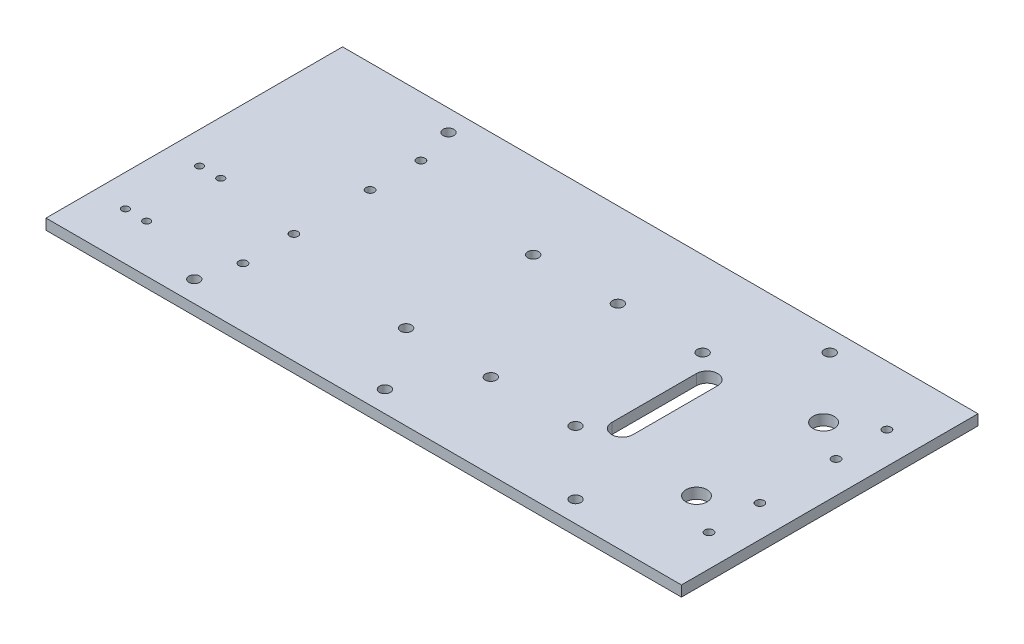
from build123d import *

# Parameters (mm, degrees)
SKETCH1_W                  = 381
SKETCH1_H                  = 177.8
PLATE_DEPTH                = 6.35
SKETCH4_R                  = 3.2639
CHASSISMOUNTINGHOLES_DEPTH = 6.35
SKETCH5_R                  = 2.5019
LEADSCREWGUIDEMOUNTS_DEPTH = 6.35
SKETCH6_R                  = 2.15265
LEADSCREWMOTORMOUNT_DEPTH  = 6.35
SKETCH8_R                  = 3.2639
CUT_EXTRUDE2_DEPTH         = 211.318288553
SKETCH9_R                  = 6.35
CUT_EXTRUDE3_DEPTH         = 211.318288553


with BuildPart() as part:
    # Sketch1 → Plate (new body)
    with BuildSketch(Plane(origin=(0, 0, 0), x_dir=(1, 0, 0), z_dir=(0, 1, 0))):
        Rectangle(SKETCH1_W, SKETCH1_H)
    extrude(amount=PLATE_DEPTH)

    # Sketch4 → ChassisMountingHoles (cut)
    with BuildSketch(Plane.XZ):
        with Locations(Location((0, 76.2, 0), (0, 0, 270))):
            Circle(SKETCH4_R)
        with Locations(Location((-114.3, 76.2, 0), (0, 0, 270))):
            Circle(SKETCH4_R)
        with Locations(Location((114.3, 76.2, 0), (0, 0, 270))):
            Circle(SKETCH4_R)
        with Locations(Location((-114.3, -76.2, 0), (0, 0, 270))):
            Circle(SKETCH4_R)
        with Locations(Location((114.3, -76.2, 0), (0, 0, 270))):
            Circle(SKETCH4_R)
    extrude(amount=-CHASSISMOUNTINGHOLES_DEPTH, mode=Mode.SUBTRACT)

    # Sketch5 → LeadScrewGuideMounts (cut)
    with BuildSketch(Plane.XZ):
        with Locations(Location((171.45, 53.34, 0), (0, 0, 270))):
            Circle(SKETCH5_R)
        with Locations(Location((171.45, 22.86, 0), (0, 0, 270))):
            Circle(SKETCH5_R)
        with Locations(Location((-107.95, 53.34, 0), (0, 0, 270))):
            Circle(SKETCH5_R)
        with Locations(Location((-107.95, 22.86, 0), (0, 0, 270))):
            Circle(SKETCH5_R)
        with Locations(Location((171.45, -53.34, 0), (0, 0, 270))):
            Circle(SKETCH5_R)
        with Locations(Location((171.45, -22.86, 0), (0, 0, 270))):
            Circle(SKETCH5_R)
        with Locations(Location((-107.95, -22.86, 0), (0, 0, 270))):
            Circle(SKETCH5_R)
        with Locations(Location((-107.95, -53.34, 0), (0, 0, 270))):
            Circle(SKETCH5_R)
    extrude(amount=-LEADSCREWGUIDEMOUNTS_DEPTH, mode=Mode.SUBTRACT)

    # Sketch6 → LeadScrewMotorMount (cut)
    with BuildSketch(Plane.XZ):
        with Locations(Location((-171.45, 60.325, 0), (0, 0, 270))):
            Circle(SKETCH6_R)
        with Locations(Location((-158.75, 60.325, 0), (0, 0, 270))):
            Circle(SKETCH6_R)
        with Locations(Location((-171.45, 15.875, 0), (0, 0, 270))):
            Circle(SKETCH6_R)
        with Locations(Location((-158.75, 15.875, 0), (0, 0, 270))):
            Circle(SKETCH6_R)
    extrude(amount=-LEADSCREWMOTORMOUNT_DEPTH, mode=Mode.SUBTRACT)

    # Sketch8 → Cut-Extrude2 (cut, through all)
    with BuildSketch(Plane.XZ):
        with Locations(Location((-25.4, 38.1, 0), (0, 0, 270))):
            Circle(SKETCH8_R)
        with Locations(Location((25.4, 38.1, 0), (0, 0, 270))):
            Circle(SKETCH8_R)
        with Locations(Location((76.2, 38.1, 0), (0, 0, 270))):
            Circle(SKETCH8_R)
    cut_extrude2 = extrude(amount=-CUT_EXTRUDE2_DEPTH, mode=Mode.SUBTRACT)

    # Mirror1: Cut-Extrude2 across plane
    add(cut_extrude2.mirror(Plane.XY), mode=Mode.SUBTRACT)

    # Sketch9 → Cut-Extrude3 (cut, through all)
    with BuildSketch(Plane.XZ):
        with Locations(Location((148.717, 38.1, 0), (0, 0, 270))):
            Circle(SKETCH9_R)
        with BuildLine():
            Line((85.217, 25.4), (85.217, 0))
            Line((85.217, 0), (97.917, 0))
            Line((97.917, 0), (97.917, 25.4))
            ThreePointArc((97.917, 25.4), (91.567, 31.75), (85.217, 25.4))
        make_face()
    cut_extrude3 = extrude(amount=-CUT_EXTRUDE3_DEPTH, mode=Mode.SUBTRACT)

    # Mirror2: Cut-Extrude3 across plane
    add(cut_extrude3.mirror(Plane.XY), mode=Mode.SUBTRACT)


solid = part.part
